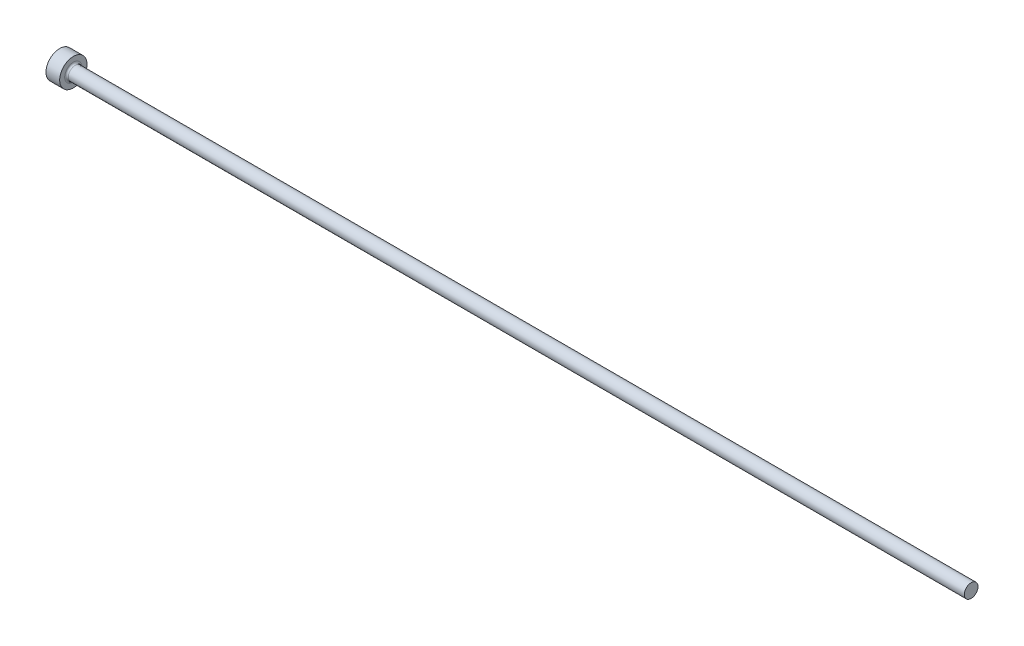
ISO-10303-21;
HEADER;
FILE_DESCRIPTION(('STEP AP214'),'2;1');
FILE_NAME('part.step','',(''),(''),'','','');
FILE_SCHEMA(('AUTOMOTIVE_DESIGN { 1 0 10303 214 1 1 1 1 }'));
ENDSEC;
DATA;
#1=APPLICATION_CONTEXT('core data for automotive mechanical design processes');
#2=APPLICATION_PROTOCOL_DEFINITION('international standard','automotive_design',2000,#1);
#3=PRODUCT_CONTEXT('',#1,'mechanical');
#4=PRODUCT('Part','Part','',(#3));
#5=PRODUCT_RELATED_PRODUCT_CATEGORY('part','',(#4));
#6=PRODUCT_DEFINITION_FORMATION('','',#4);
#7=PRODUCT_DEFINITION_CONTEXT('part definition',#1,'design');
#8=PRODUCT_DEFINITION('design','',#6,#7);
#9=PRODUCT_DEFINITION_SHAPE('','',#8);
#10=(LENGTH_UNIT() NAMED_UNIT(*) SI_UNIT(.MILLI.,.METRE.));
#11=(NAMED_UNIT(*) PLANE_ANGLE_UNIT() SI_UNIT($,.RADIAN.));
#12=(NAMED_UNIT(*) SI_UNIT($,.STERADIAN.) SOLID_ANGLE_UNIT());
#13=UNCERTAINTY_MEASURE_WITH_UNIT(LENGTH_MEASURE(1.E-05),#10,'distance_accuracy_value','');
#14=(GEOMETRIC_REPRESENTATION_CONTEXT(3) GLOBAL_UNCERTAINTY_ASSIGNED_CONTEXT((#13)) GLOBAL_UNIT_ASSIGNED_CONTEXT((#10,
#11,#12)) REPRESENTATION_CONTEXT('',''));
#15=CARTESIAN_POINT('',(0.,0.,0.));
#16=DIRECTION('',(0.,0.,1.));
#17=DIRECTION('',(1.,0.,0.));
#18=AXIS2_PLACEMENT_3D('',#15,#16,#17);
#19=CARTESIAN_POINT('',(0.,0.,0.));
#20=DIRECTION('',(-1.,0.,0.));
#21=DIRECTION('',(0.,-1.,0.));
#22=AXIS2_PLACEMENT_3D('',#19,#20,#21);
#23=PLANE('',#22);
#24=CARTESIAN_POINT('',(0.,0.,0.));
#25=DIRECTION('',(1.,0.,0.));
#26=DIRECTION('',(0.,1.,0.));
#27=AXIS2_PLACEMENT_3D('',#24,#25,#26);
#28=CIRCLE('',#27,1.5);
#29=CARTESIAN_POINT('',(0.,1.5,0.));
#30=VERTEX_POINT('',#29);
#31=EDGE_CURVE('E24',#30,#30,#28,.T.);
#32=ORIENTED_EDGE('',*,*,#31,.F.);
#33=EDGE_LOOP('',(#32));
#34=FACE_BOUND('',#33,.T.);
#35=ADVANCED_FACE('F13',(#34),#23,.T.);
#36=CARTESIAN_POINT('',(100.,0.,0.));
#37=DIRECTION('',(1.,0.,0.));
#38=DIRECTION('',(0.,1.,0.));
#39=AXIS2_PLACEMENT_3D('',#36,#37,#38);
#40=CYLINDRICAL_SURFACE('',#39,1.5);
#41=ORIENTED_EDGE('',*,*,#31,.T.);
#42=EDGE_LOOP('',(#41));
#43=FACE_BOUND('',#42,.T.);
#44=CARTESIAN_POINT('',(1.5,0.,0.));
#45=DIRECTION('',(1.,0.,0.));
#46=DIRECTION('',(0.,1.,0.));
#47=AXIS2_PLACEMENT_3D('',#44,#45,#46);
#48=CIRCLE('',#47,1.5);
#49=CARTESIAN_POINT('',(1.5,1.5,0.));
#50=VERTEX_POINT('',#49);
#51=EDGE_CURVE('E28',#50,#50,#48,.T.);
#52=ORIENTED_EDGE('',*,*,#51,.F.);
#53=EDGE_LOOP('',(#52));
#54=FACE_BOUND('',#53,.T.);
#55=ADVANCED_FACE('F50',(#43,#54),#40,.T.);
#56=CARTESIAN_POINT('',(1.5,1.5,0.));
#57=DIRECTION('',(1.,0.,0.));
#58=DIRECTION('',(0.,1.,0.));
#59=AXIS2_PLACEMENT_3D('',#56,#57,#58);
#60=PLANE('',#59);
#61=CARTESIAN_POINT('',(1.5,0.,0.));
#62=DIRECTION('',(1.,0.,0.));
#63=DIRECTION('',(0.,1.,0.));
#64=AXIS2_PLACEMENT_3D('',#61,#62,#63);
#65=CIRCLE('',#64,0.949999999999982);
#66=CARTESIAN_POINT('',(1.5,0.949999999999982,0.));
#67=VERTEX_POINT('',#66);
#68=EDGE_CURVE('E8',#67,#67,#65,.F.);
#69=ORIENTED_EDGE('',*,*,#68,.T.);
#70=EDGE_LOOP('',(#69));
#71=FACE_BOUND('',#70,.T.);
#72=ORIENTED_EDGE('',*,*,#51,.T.);
#73=EDGE_LOOP('',(#72));
#74=FACE_BOUND('',#73,.T.);
#75=ADVANCED_FACE('F41',(#71,#74),#60,.T.);
#76=CARTESIAN_POINT('',(100.,0.,0.));
#77=DIRECTION('',(1.,0.,0.));
#78=DIRECTION('',(0.,1.,0.));
#79=AXIS2_PLACEMENT_3D('',#76,#77,#78);
#80=CYLINDRICAL_SURFACE('',#79,0.749999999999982);
#81=CARTESIAN_POINT('',(1.7,0.,0.));
#82=DIRECTION('',(1.,0.,0.));
#83=DIRECTION('',(0.,1.,0.));
#84=AXIS2_PLACEMENT_3D('',#81,#82,#83);
#85=CIRCLE('',#84,0.749999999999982);
#86=CARTESIAN_POINT('',(1.7,0.749999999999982,0.));
#87=VERTEX_POINT('',#86);
#88=EDGE_CURVE('E20',#87,#87,#85,.T.);
#89=ORIENTED_EDGE('',*,*,#88,.T.);
#90=EDGE_LOOP('',(#89));
#91=FACE_BOUND('',#90,.T.);
#92=CARTESIAN_POINT('',(100.,0.,0.));
#93=DIRECTION('',(1.,0.,0.));
#94=DIRECTION('',(0.,1.,0.));
#95=AXIS2_PLACEMENT_3D('',#92,#93,#94);
#96=CIRCLE('',#95,0.749999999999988);
#97=CARTESIAN_POINT('',(100.,0.749999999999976,0.));
#98=VERTEX_POINT('',#97);
#99=EDGE_CURVE('E33',#98,#98,#96,.T.);
#100=ORIENTED_EDGE('',*,*,#99,.F.);
#101=EDGE_LOOP('',(#100));
#102=FACE_BOUND('',#101,.T.);
#103=ADVANCED_FACE('F39',(#91,#102),#80,.T.);
#104=CARTESIAN_POINT('',(100.,0.749999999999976,0.));
#105=DIRECTION('',(1.,0.,0.));
#106=DIRECTION('',(0.,1.,0.));
#107=AXIS2_PLACEMENT_3D('',#104,#105,#106);
#108=PLANE('',#107);
#109=ORIENTED_EDGE('',*,*,#99,.T.);
#110=EDGE_LOOP('',(#109));
#111=FACE_BOUND('',#110,.T.);
#112=ADVANCED_FACE('F37',(#111),#108,.T.);
#113=CARTESIAN_POINT('',(1.7,0.,0.));
#114=DIRECTION('',(1.,0.,0.));
#115=DIRECTION('',(0.,1.,0.));
#116=AXIS2_PLACEMENT_3D('',#113,#114,#115);
#117=TOROIDAL_SURFACE('',#116,0.949999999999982,0.2);
#118=ORIENTED_EDGE('',*,*,#68,.F.);
#119=EDGE_LOOP('',(#118));
#120=FACE_BOUND('',#119,.T.);
#121=ORIENTED_EDGE('',*,*,#88,.F.);
#122=EDGE_LOOP('',(#121));
#123=FACE_BOUND('',#122,.T.);
#124=ADVANCED_FACE('F15',(#120,#123),#117,.F.);
#125=CLOSED_SHELL('',(#35,#55,#75,#103,#112,#124));
#126=MANIFOLD_SOLID_BREP('B1',#125);
#127=ADVANCED_BREP_SHAPE_REPRESENTATION('',(#18,#126),#14);
#128=SHAPE_DEFINITION_REPRESENTATION(#9,#127);
ENDSEC;
END-ISO-10303-21;
